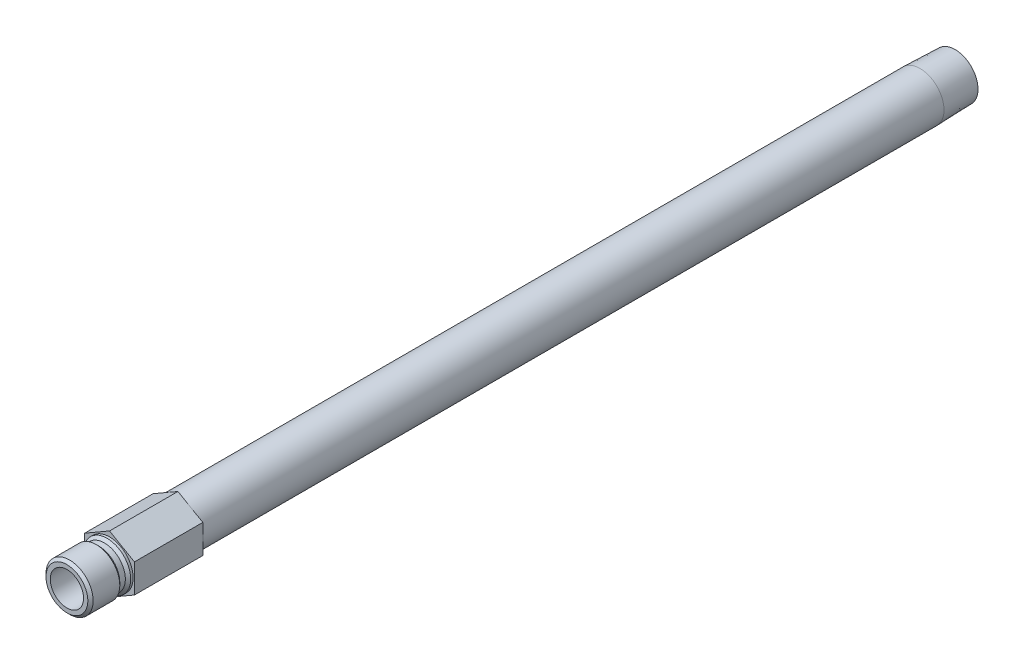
ISO-10303-21;
HEADER;
FILE_DESCRIPTION(('STEP AP214'),'2;1');
FILE_NAME('part.step','',(''),(''),'','','');
FILE_SCHEMA(('AUTOMOTIVE_DESIGN { 1 0 10303 214 1 1 1 1 }'));
ENDSEC;
DATA;
#1=APPLICATION_CONTEXT('core data for automotive mechanical design processes');
#2=APPLICATION_PROTOCOL_DEFINITION('international standard','automotive_design',2000,#1);
#3=PRODUCT_CONTEXT('',#1,'mechanical');
#4=PRODUCT('Part','Part','',(#3));
#5=PRODUCT_RELATED_PRODUCT_CATEGORY('part','',(#4));
#6=PRODUCT_DEFINITION_FORMATION('','',#4);
#7=PRODUCT_DEFINITION_CONTEXT('part definition',#1,'design');
#8=PRODUCT_DEFINITION('design','',#6,#7);
#9=PRODUCT_DEFINITION_SHAPE('','',#8);
#10=(LENGTH_UNIT() NAMED_UNIT(*) SI_UNIT(.MILLI.,.METRE.));
#11=(NAMED_UNIT(*) PLANE_ANGLE_UNIT() SI_UNIT($,.RADIAN.));
#12=(NAMED_UNIT(*) SI_UNIT($,.STERADIAN.) SOLID_ANGLE_UNIT());
#13=UNCERTAINTY_MEASURE_WITH_UNIT(LENGTH_MEASURE(1.E-05),#10,'distance_accuracy_value','');
#14=(GEOMETRIC_REPRESENTATION_CONTEXT(3) GLOBAL_UNCERTAINTY_ASSIGNED_CONTEXT((#13)) GLOBAL_UNIT_ASSIGNED_CONTEXT((#10,
#11,#12)) REPRESENTATION_CONTEXT('',''));
#15=CARTESIAN_POINT('',(0.,0.,0.));
#16=DIRECTION('',(0.,0.,1.));
#17=DIRECTION('',(1.,0.,0.));
#18=AXIS2_PLACEMENT_3D('',#15,#16,#17);
#19=CARTESIAN_POINT('',(0.,0.,0.));
#20=DIRECTION('',(0.,0.,-1.));
#21=DIRECTION('',(0.,1.,0.));
#22=AXIS2_PLACEMENT_3D('',#19,#20,#21);
#23=CYLINDRICAL_SURFACE('',#22,4.7625);
#24=CARTESIAN_POINT('',(0.,0.,0.));
#25=DIRECTION('',(0.,0.,1.));
#26=DIRECTION('',(1.,0.,0.));
#27=AXIS2_PLACEMENT_3D('',#24,#25,#26);
#28=CIRCLE('',#27,4.7625);
#29=CARTESIAN_POINT('',(4.7625,0.,0.));
#30=VERTEX_POINT('',#29);
#31=EDGE_CURVE('E138',#30,#30,#28,.T.);
#32=ORIENTED_EDGE('',*,*,#31,.F.);
#33=EDGE_LOOP('',(#32));
#34=FACE_BOUND('',#33,.T.);
#35=CARTESIAN_POINT('',(0.,0.,12.192));
#36=DIRECTION('',(0.,0.,-1.));
#37=DIRECTION('',(0.,1.,0.));
#38=AXIS2_PLACEMENT_3D('',#35,#36,#37);
#39=CIRCLE('',#38,4.7625);
#40=CARTESIAN_POINT('',(0.,4.7625,12.192));
#41=VERTEX_POINT('',#40);
#42=EDGE_CURVE('E11',#41,#41,#39,.T.);
#43=ORIENTED_EDGE('',*,*,#42,.F.);
#44=EDGE_LOOP('',(#43));
#45=FACE_BOUND('',#44,.T.);
#46=ADVANCED_FACE('F33',(#34,#45),#23,.F.);
#47=CARTESIAN_POINT('',(0.,4.7625,12.192));
#48=DIRECTION('',(0.,0.,1.));
#49=DIRECTION('',(0.,-1.,0.));
#50=AXIS2_PLACEMENT_3D('',#47,#48,#49);
#51=PLANE('',#50);
#52=ORIENTED_EDGE('',*,*,#42,.T.);
#53=EDGE_LOOP('',(#52));
#54=FACE_BOUND('',#53,.T.);
#55=CARTESIAN_POINT('',(0.,0.,12.192));
#56=DIRECTION('',(0.,0.,-1.));
#57=DIRECTION('',(0.,1.,0.));
#58=AXIS2_PLACEMENT_3D('',#55,#56,#57);
#59=CIRCLE('',#58,5.9817);
#60=CARTESIAN_POINT('',(0.,5.9817,12.192));
#61=VERTEX_POINT('',#60);
#62=EDGE_CURVE('E41',#61,#61,#59,.T.);
#63=ORIENTED_EDGE('',*,*,#62,.F.);
#64=EDGE_LOOP('',(#63));
#65=FACE_BOUND('',#64,.T.);
#66=ADVANCED_FACE('F181',(#54,#65),#51,.T.);
#67=CARTESIAN_POINT('',(0.,0.,11.43));
#68=DIRECTION('',(0.,0.,-1.));
#69=DIRECTION('',(0.,1.,0.));
#70=AXIS2_PLACEMENT_3D('',#67,#68,#69);
#71=CONICAL_SURFACE('',#70,6.7437,0.785398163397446);
#72=ORIENTED_EDGE('',*,*,#62,.T.);
#73=EDGE_LOOP('',(#72));
#74=FACE_BOUND('',#73,.T.);
#75=CARTESIAN_POINT('',(0.,0.,11.43));
#76=DIRECTION('',(0.,0.,-1.));
#77=DIRECTION('',(0.,1.,0.));
#78=AXIS2_PLACEMENT_3D('',#75,#76,#77);
#79=CIRCLE('',#78,6.7437);
#80=CARTESIAN_POINT('',(0.,6.7437,11.43));
#81=VERTEX_POINT('',#80);
#82=EDGE_CURVE('E173',#81,#81,#79,.T.);
#83=ORIENTED_EDGE('',*,*,#82,.F.);
#84=EDGE_LOOP('',(#83));
#85=FACE_BOUND('',#84,.T.);
#86=ADVANCED_FACE('F178',(#74,#85),#71,.T.);
#87=CARTESIAN_POINT('',(0.,0.,0.));
#88=DIRECTION('',(0.,0.,-1.));
#89=DIRECTION('',(0.,1.,0.));
#90=AXIS2_PLACEMENT_3D('',#87,#88,#89);
#91=CYLINDRICAL_SURFACE('',#90,6.7437);
#92=ORIENTED_EDGE('',*,*,#82,.T.);
#93=EDGE_LOOP('',(#92));
#94=FACE_BOUND('',#93,.T.);
#95=CARTESIAN_POINT('',(0.,0.,3.81));
#96=DIRECTION('',(0.,0.,-1.));
#97=DIRECTION('',(0.,1.,0.));
#98=AXIS2_PLACEMENT_3D('',#95,#96,#97);
#99=CIRCLE('',#98,6.7437);
#100=CARTESIAN_POINT('',(0.,6.7437,3.81));
#101=VERTEX_POINT('',#100);
#102=EDGE_CURVE('E170',#101,#101,#99,.T.);
#103=ORIENTED_EDGE('',*,*,#102,.F.);
#104=EDGE_LOOP('',(#103));
#105=FACE_BOUND('',#104,.T.);
#106=ADVANCED_FACE('F188',(#94,#105),#91,.T.);
#107=CARTESIAN_POINT('',(0.,0.,3.048));
#108=DIRECTION('',(0.,0.,1.));
#109=DIRECTION('',(0.,-1.,0.));
#110=AXIS2_PLACEMENT_3D('',#107,#108,#109);
#111=CONICAL_SURFACE('',#110,5.9817,0.785398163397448);
#112=ORIENTED_EDGE('',*,*,#102,.T.);
#113=EDGE_LOOP('',(#112));
#114=FACE_BOUND('',#113,.T.);
#115=CARTESIAN_POINT('',(0.,0.,3.048));
#116=DIRECTION('',(0.,0.,-1.));
#117=DIRECTION('',(0.,1.,0.));
#118=AXIS2_PLACEMENT_3D('',#115,#116,#117);
#119=CIRCLE('',#118,5.9817);
#120=CARTESIAN_POINT('',(0.,5.9817,3.048));
#121=VERTEX_POINT('',#120);
#122=EDGE_CURVE('E167',#121,#121,#119,.T.);
#123=ORIENTED_EDGE('',*,*,#122,.F.);
#124=EDGE_LOOP('',(#123));
#125=FACE_BOUND('',#124,.T.);
#126=ADVANCED_FACE('F194',(#114,#125),#111,.T.);
#127=CARTESIAN_POINT('',(0.,0.,0.));
#128=DIRECTION('',(0.,0.,-1.));
#129=DIRECTION('',(0.,1.,0.));
#130=AXIS2_PLACEMENT_3D('',#127,#128,#129);
#131=CYLINDRICAL_SURFACE('',#130,5.9817);
#132=ORIENTED_EDGE('',*,*,#122,.T.);
#133=EDGE_LOOP('',(#132));
#134=FACE_BOUND('',#133,.T.);
#135=CARTESIAN_POINT('',(0.,0.,1.4605));
#136=DIRECTION('',(0.,0.,-1.));
#137=DIRECTION('',(0.,1.,0.));
#138=AXIS2_PLACEMENT_3D('',#135,#136,#137);
#139=CIRCLE('',#138,5.9817);
#140=CARTESIAN_POINT('',(0.,5.9817,1.4605));
#141=VERTEX_POINT('',#140);
#142=EDGE_CURVE('E164',#141,#141,#139,.T.);
#143=ORIENTED_EDGE('',*,*,#142,.F.);
#144=EDGE_LOOP('',(#143));
#145=FACE_BOUND('',#144,.T.);
#146=ADVANCED_FACE('F198',(#134,#145),#131,.T.);
#147=CARTESIAN_POINT('',(0.,0.,0.698499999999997));
#148=DIRECTION('',(0.,0.,-1.));
#149=DIRECTION('',(0.,1.,0.));
#150=AXIS2_PLACEMENT_3D('',#147,#148,#149);
#151=CONICAL_SURFACE('',#150,6.7437,0.785398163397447);
#152=ORIENTED_EDGE('',*,*,#142,.T.);
#153=EDGE_LOOP('',(#152));
#154=FACE_BOUND('',#153,.T.);
#155=CARTESIAN_POINT('',(0.,0.,0.698499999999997));
#156=DIRECTION('',(0.,0.,-1.));
#157=DIRECTION('',(0.,1.,0.));
#158=AXIS2_PLACEMENT_3D('',#155,#156,#157);
#159=CIRCLE('',#158,6.7437);
#160=CARTESIAN_POINT('',(0.,6.7437,0.698499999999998));
#161=VERTEX_POINT('',#160);
#162=EDGE_CURVE('E161',#161,#161,#159,.T.);
#163=ORIENTED_EDGE('',*,*,#162,.F.);
#164=EDGE_LOOP('',(#163));
#165=FACE_BOUND('',#164,.T.);
#166=ADVANCED_FACE('F202',(#154,#165),#151,.T.);
#167=CARTESIAN_POINT('',(0.,0.,0.));
#168=DIRECTION('',(0.,0.,-1.));
#169=DIRECTION('',(0.,1.,0.));
#170=AXIS2_PLACEMENT_3D('',#167,#168,#169);
#171=CYLINDRICAL_SURFACE('',#170,6.7437);
#172=ORIENTED_EDGE('',*,*,#162,.T.);
#173=EDGE_LOOP('',(#172));
#174=FACE_BOUND('',#173,.T.);
#175=CARTESIAN_POINT('',(0.,0.,0.));
#176=DIRECTION('',(0.,0.,-1.));
#177=DIRECTION('',(0.,1.,0.));
#178=AXIS2_PLACEMENT_3D('',#175,#176,#177);
#179=CIRCLE('',#178,6.7437);
#180=CARTESIAN_POINT('',(0.,6.7437,0.));
#181=VERTEX_POINT('',#180);
#182=EDGE_CURVE('E158',#181,#181,#179,.T.);
#183=ORIENTED_EDGE('',*,*,#182,.F.);
#184=EDGE_LOOP('',(#183));
#185=FACE_BOUND('',#184,.T.);
#186=ADVANCED_FACE('F206',(#174,#185),#171,.T.);
#187=CARTESIAN_POINT('',(0.,6.7437,0.));
#188=DIRECTION('',(0.,0.,1.));
#189=DIRECTION('',(0.,-1.,0.));
#190=AXIS2_PLACEMENT_3D('',#187,#188,#189);
#191=PLANE('',#190);
#192=ORIENTED_EDGE('',*,*,#182,.T.);
#193=EDGE_LOOP('',(#192));
#194=FACE_BOUND('',#193,.T.);
#195=DIRECTION('',(-0.866025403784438,-0.5,0.));
#196=VECTOR('',#195,1.);
#197=CARTESIAN_POINT('',(0.,8.21223022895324,0.));
#198=LINE('',#197,#196);
#199=CARTESIAN_POINT('',(0.,8.21223022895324,0.));
#200=VERTEX_POINT('',#199);
#201=CARTESIAN_POINT('',(-7.112,4.10611511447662,0.));
#202=VERTEX_POINT('',#201);
#203=EDGE_CURVE('E120',#200,#202,#198,.T.);
#204=ORIENTED_EDGE('',*,*,#203,.T.);
#205=DIRECTION('',(0.,-1.,0.));
#206=VECTOR('',#205,1.);
#207=CARTESIAN_POINT('',(-7.112,4.10611511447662,0.));
#208=LINE('',#207,#206);
#209=CARTESIAN_POINT('',(-7.112,-4.10611511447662,0.));
#210=VERTEX_POINT('',#209);
#211=EDGE_CURVE('E123',#202,#210,#208,.T.);
#212=ORIENTED_EDGE('',*,*,#211,.T.);
#213=DIRECTION('',(0.866025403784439,-0.5,0.));
#214=VECTOR('',#213,1.);
#215=CARTESIAN_POINT('',(-7.112,-4.10611511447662,0.));
#216=LINE('',#215,#214);
#217=CARTESIAN_POINT('',(0.,-8.21223022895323,0.));
#218=VERTEX_POINT('',#217);
#219=EDGE_CURVE('E127',#210,#218,#216,.T.);
#220=ORIENTED_EDGE('',*,*,#219,.T.);
#221=DIRECTION('',(0.866025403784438,0.5,0.));
#222=VECTOR('',#221,1.);
#223=CARTESIAN_POINT('',(0.,-8.21223022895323,0.));
#224=LINE('',#223,#222);
#225=CARTESIAN_POINT('',(7.112,-4.10611511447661,0.));
#226=VERTEX_POINT('',#225);
#227=EDGE_CURVE('E130',#218,#226,#224,.T.);
#228=ORIENTED_EDGE('',*,*,#227,.T.);
#229=DIRECTION('',(0.,1.,0.));
#230=VECTOR('',#229,1.);
#231=CARTESIAN_POINT('',(7.112,-4.10611511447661,0.));
#232=LINE('',#231,#230);
#233=CARTESIAN_POINT('',(7.112,4.10611511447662,0.));
#234=VERTEX_POINT('',#233);
#235=EDGE_CURVE('E97',#226,#234,#232,.T.);
#236=ORIENTED_EDGE('',*,*,#235,.T.);
#237=DIRECTION('',(-0.866025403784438,0.5,0.));
#238=VECTOR('',#237,1.);
#239=CARTESIAN_POINT('',(7.112,4.10611511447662,0.));
#240=LINE('',#239,#238);
#241=EDGE_CURVE('E133',#234,#200,#240,.T.);
#242=ORIENTED_EDGE('',*,*,#241,.T.);
#243=EDGE_LOOP('',(#204,#212,#220,#228,#236,#242));
#244=FACE_BOUND('',#243,.T.);
#245=ADVANCED_FACE('F210',(#194,#244),#191,.T.);
#246=CARTESIAN_POINT('',(-7.112,4.10611511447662,0.));
#247=DIRECTION('',(0.,0.,1.));
#248=DIRECTION('',(1.,0.,0.));
#249=AXIS2_PLACEMENT_3D('',#246,#247,#248);
#250=PLANE('',#249);
#251=ORIENTED_EDGE('',*,*,#31,.T.);
#252=EDGE_LOOP('',(#251));
#253=FACE_BOUND('',#252,.T.);
#254=CARTESIAN_POINT('',(0.,0.,0.));
#255=DIRECTION('',(0.,0.,1.));
#256=DIRECTION('',(1.,0.,0.));
#257=AXIS2_PLACEMENT_3D('',#254,#255,#256);
#258=CIRCLE('',#257,4.62279999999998);
#259=CARTESIAN_POINT('',(4.62279999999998,0.,0.));
#260=VERTEX_POINT('',#259);
#261=EDGE_CURVE('E124',#260,#260,#258,.T.);
#262=ORIENTED_EDGE('',*,*,#261,.F.);
#263=EDGE_LOOP('',(#262));
#264=FACE_BOUND('',#263,.T.);
#265=ADVANCED_FACE('F214',(#253,#264),#250,.T.);
#266=CARTESIAN_POINT('',(0.,0.,-241.808));
#267=DIRECTION('',(0.,0.,1.));
#268=DIRECTION('',(0.,-1.,0.));
#269=AXIS2_PLACEMENT_3D('',#266,#267,#268);
#270=CONICAL_SURFACE('',#269,6.54447060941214,0.0312396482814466);
#271=CARTESIAN_POINT('',(0.,0.,-231.775));
#272=DIRECTION('',(0.,0.,-1.));
#273=DIRECTION('',(0.,1.,0.));
#274=AXIS2_PLACEMENT_3D('',#271,#272,#273);
#275=CIRCLE('',#274,6.85799999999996);
#276=CARTESIAN_POINT('',(0.,6.858,-231.775));
#277=VERTEX_POINT('',#276);
#278=EDGE_CURVE('E155',#277,#277,#275,.T.);
#279=ORIENTED_EDGE('',*,*,#278,.T.);
#280=EDGE_LOOP('',(#279));
#281=FACE_BOUND('',#280,.T.);
#282=CARTESIAN_POINT('',(0.,0.,-241.808));
#283=DIRECTION('',(0.,0.,-1.));
#284=DIRECTION('',(0.,1.,0.));
#285=AXIS2_PLACEMENT_3D('',#282,#283,#284);
#286=CIRCLE('',#285,6.54447060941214);
#287=CARTESIAN_POINT('',(0.,6.54447060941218,-241.808));
#288=VERTEX_POINT('',#287);
#289=EDGE_CURVE('E152',#288,#288,#286,.T.);
#290=ORIENTED_EDGE('',*,*,#289,.F.);
#291=EDGE_LOOP('',(#290));
#292=FACE_BOUND('',#291,.T.);
#293=ADVANCED_FACE('F220',(#281,#292),#270,.T.);
#294=CARTESIAN_POINT('',(0.,0.,0.));
#295=DIRECTION('',(0.,0.,-1.));
#296=DIRECTION('',(0.,1.,0.));
#297=AXIS2_PLACEMENT_3D('',#294,#295,#296);
#298=CYLINDRICAL_SURFACE('',#297,6.85799999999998);
#299=ORIENTED_EDGE('',*,*,#278,.F.);
#300=EDGE_LOOP('',(#299));
#301=FACE_BOUND('',#300,.T.);
#302=CARTESIAN_POINT('',(0.,0.,-19.558));
#303=DIRECTION('',(0.,0.,1.));
#304=DIRECTION('',(1.,0.,0.));
#305=AXIS2_PLACEMENT_3D('',#302,#303,#304);
#306=CIRCLE('',#305,6.85799999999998);
#307=CARTESIAN_POINT('',(6.85799999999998,0.,-19.558));
#308=VERTEX_POINT('',#307);
#309=EDGE_CURVE('E146',#308,#308,#306,.F.);
#310=ORIENTED_EDGE('',*,*,#309,.T.);
#311=EDGE_LOOP('',(#310));
#312=FACE_BOUND('',#311,.T.);
#313=ADVANCED_FACE('F216',(#301,#312),#298,.T.);
#314=CARTESIAN_POINT('',(0.,6.54447060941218,-241.808));
#315=DIRECTION('',(0.,0.,-1.));
#316=DIRECTION('',(0.,1.,0.));
#317=AXIS2_PLACEMENT_3D('',#314,#315,#316);
#318=PLANE('',#317);
#319=ORIENTED_EDGE('',*,*,#289,.T.);
#320=EDGE_LOOP('',(#319));
#321=FACE_BOUND('',#320,.T.);
#322=CARTESIAN_POINT('',(0.,0.,-241.808));
#323=DIRECTION('',(0.,0.,-1.));
#324=DIRECTION('',(0.,1.,0.));
#325=AXIS2_PLACEMENT_3D('',#322,#323,#324);
#326=CIRCLE('',#325,4.62279999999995);
#327=CARTESIAN_POINT('',(0.,4.6228,-241.808));
#328=VERTEX_POINT('',#327);
#329=EDGE_CURVE('E149',#328,#328,#326,.T.);
#330=ORIENTED_EDGE('',*,*,#329,.F.);
#331=EDGE_LOOP('',(#330));
#332=FACE_BOUND('',#331,.T.);
#333=ADVANCED_FACE('F219',(#321,#332),#318,.T.);
#334=CARTESIAN_POINT('',(0.,0.,0.));
#335=DIRECTION('',(0.,0.,-1.));
#336=DIRECTION('',(0.,1.,0.));
#337=AXIS2_PLACEMENT_3D('',#334,#335,#336);
#338=CYLINDRICAL_SURFACE('',#337,4.62279999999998);
#339=ORIENTED_EDGE('',*,*,#261,.T.);
#340=EDGE_LOOP('',(#339));
#341=FACE_BOUND('',#340,.T.);
#342=ORIENTED_EDGE('',*,*,#329,.T.);
#343=EDGE_LOOP('',(#342));
#344=FACE_BOUND('',#343,.T.);
#345=ADVANCED_FACE('F227',(#341,#344),#338,.F.);
#346=CARTESIAN_POINT('',(0.,8.21223022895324,-19.558));
#347=DIRECTION('',(-0.5,0.866025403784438,0.));
#348=DIRECTION('',(-0.866025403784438,-0.5,0.));
#349=AXIS2_PLACEMENT_3D('',#346,#347,#348);
#350=PLANE('',#349);
#351=ORIENTED_EDGE('',*,*,#203,.F.);
#352=DIRECTION('',(0.,0.,1.));
#353=VECTOR('',#352,1.);
#354=CARTESIAN_POINT('',(0.,8.21223022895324,-19.558));
#355=LINE('',#354,#353);
#356=CARTESIAN_POINT('',(0.,8.21223022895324,-19.558));
#357=VERTEX_POINT('',#356);
#358=EDGE_CURVE('E49',#357,#200,#355,.T.);
#359=ORIENTED_EDGE('',*,*,#358,.F.);
#360=DIRECTION('',(-0.866025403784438,-0.5,0.));
#361=VECTOR('',#360,1.);
#362=CARTESIAN_POINT('',(0.,8.21223022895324,-19.558));
#363=LINE('',#362,#361);
#364=CARTESIAN_POINT('',(-7.112,4.10611511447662,-19.558));
#365=VERTEX_POINT('',#364);
#366=EDGE_CURVE('E136',#357,#365,#363,.T.);
#367=ORIENTED_EDGE('',*,*,#366,.T.);
#368=DIRECTION('',(0.,0.,1.));
#369=VECTOR('',#368,1.);
#370=CARTESIAN_POINT('',(-7.112,4.10611511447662,-19.558));
#371=LINE('',#370,#369);
#372=EDGE_CURVE('E84',#365,#202,#371,.T.);
#373=ORIENTED_EDGE('',*,*,#372,.T.);
#374=EDGE_LOOP('',(#351,#359,#367,#373));
#375=FACE_BOUND('',#374,.T.);
#376=ADVANCED_FACE('F231',(#375),#350,.T.);
#377=CARTESIAN_POINT('',(7.112,4.10611511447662,-19.558));
#378=DIRECTION('',(0.5,0.866025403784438,0.));
#379=DIRECTION('',(-0.866025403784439,0.5,0.));
#380=AXIS2_PLACEMENT_3D('',#377,#378,#379);
#381=PLANE('',#380);
#382=ORIENTED_EDGE('',*,*,#241,.F.);
#383=DIRECTION('',(0.,0.,1.));
#384=VECTOR('',#383,1.);
#385=CARTESIAN_POINT('',(7.112,4.10611511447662,-19.558));
#386=LINE('',#385,#384);
#387=CARTESIAN_POINT('',(7.112,4.10611511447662,-19.558));
#388=VERTEX_POINT('',#387);
#389=EDGE_CURVE('E72',#388,#234,#386,.T.);
#390=ORIENTED_EDGE('',*,*,#389,.F.);
#391=DIRECTION('',(-0.866025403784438,0.5,0.));
#392=VECTOR('',#391,1.);
#393=CARTESIAN_POINT('',(7.112,4.10611511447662,-19.558));
#394=LINE('',#393,#392);
#395=EDGE_CURVE('E110',#388,#357,#394,.T.);
#396=ORIENTED_EDGE('',*,*,#395,.T.);
#397=ORIENTED_EDGE('',*,*,#358,.T.);
#398=EDGE_LOOP('',(#382,#390,#396,#397));
#399=FACE_BOUND('',#398,.T.);
#400=ADVANCED_FACE('F235',(#399),#381,.T.);
#401=CARTESIAN_POINT('',(7.112,-4.10611511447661,-19.558));
#402=DIRECTION('',(1.,0.,0.));
#403=DIRECTION('',(0.,1.,0.));
#404=AXIS2_PLACEMENT_3D('',#401,#402,#403);
#405=PLANE('',#404);
#406=ORIENTED_EDGE('',*,*,#235,.F.);
#407=DIRECTION('',(0.,0.,1.));
#408=VECTOR('',#407,1.);
#409=CARTESIAN_POINT('',(7.112,-4.10611511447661,-19.558));
#410=LINE('',#409,#408);
#411=CARTESIAN_POINT('',(7.112,-4.10611511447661,-19.558));
#412=VERTEX_POINT('',#411);
#413=EDGE_CURVE('E92',#412,#226,#410,.T.);
#414=ORIENTED_EDGE('',*,*,#413,.F.);
#415=DIRECTION('',(0.,1.,0.));
#416=VECTOR('',#415,1.);
#417=CARTESIAN_POINT('',(7.112,-4.10611511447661,-19.558));
#418=LINE('',#417,#416);
#419=EDGE_CURVE('E95',#412,#388,#418,.T.);
#420=ORIENTED_EDGE('',*,*,#419,.T.);
#421=ORIENTED_EDGE('',*,*,#389,.T.);
#422=EDGE_LOOP('',(#406,#414,#420,#421));
#423=FACE_BOUND('',#422,.T.);
#424=ADVANCED_FACE('F94',(#423),#405,.T.);
#425=CARTESIAN_POINT('',(0.,-8.21223022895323,-19.558));
#426=DIRECTION('',(0.5,-0.866025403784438,0.));
#427=DIRECTION('',(0.866025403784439,0.5,0.));
#428=AXIS2_PLACEMENT_3D('',#425,#426,#427);
#429=PLANE('',#428);
#430=ORIENTED_EDGE('',*,*,#227,.F.);
#431=DIRECTION('',(0.,0.,1.));
#432=VECTOR('',#431,1.);
#433=CARTESIAN_POINT('',(0.,-8.21223022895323,-19.558));
#434=LINE('',#433,#432);
#435=CARTESIAN_POINT('',(0.,-8.21223022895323,-19.558));
#436=VERTEX_POINT('',#435);
#437=EDGE_CURVE('E102',#436,#218,#434,.T.);
#438=ORIENTED_EDGE('',*,*,#437,.F.);
#439=DIRECTION('',(0.866025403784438,0.5,0.));
#440=VECTOR('',#439,1.);
#441=CARTESIAN_POINT('',(0.,-8.21223022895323,-19.558));
#442=LINE('',#441,#440);
#443=EDGE_CURVE('E108',#436,#412,#442,.T.);
#444=ORIENTED_EDGE('',*,*,#443,.T.);
#445=ORIENTED_EDGE('',*,*,#413,.T.);
#446=EDGE_LOOP('',(#430,#438,#444,#445));
#447=FACE_BOUND('',#446,.T.);
#448=ADVANCED_FACE('F112',(#447),#429,.T.);
#449=CARTESIAN_POINT('',(-7.112,-4.10611511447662,-19.558));
#450=DIRECTION('',(-0.5,-0.866025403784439,0.));
#451=DIRECTION('',(0.866025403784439,-0.5,0.));
#452=AXIS2_PLACEMENT_3D('',#449,#450,#451);
#453=PLANE('',#452);
#454=ORIENTED_EDGE('',*,*,#219,.F.);
#455=DIRECTION('',(0.,0.,1.));
#456=VECTOR('',#455,1.);
#457=CARTESIAN_POINT('',(-7.112,-4.10611511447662,-19.558));
#458=LINE('',#457,#456);
#459=CARTESIAN_POINT('',(-7.112,-4.10611511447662,-19.558));
#460=VERTEX_POINT('',#459);
#461=EDGE_CURVE('E141',#460,#210,#458,.T.);
#462=ORIENTED_EDGE('',*,*,#461,.F.);
#463=DIRECTION('',(0.866025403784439,-0.5,0.));
#464=VECTOR('',#463,1.);
#465=CARTESIAN_POINT('',(-7.112,-4.10611511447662,-19.558));
#466=LINE('',#465,#464);
#467=EDGE_CURVE('E113',#460,#436,#466,.T.);
#468=ORIENTED_EDGE('',*,*,#467,.T.);
#469=ORIENTED_EDGE('',*,*,#437,.T.);
#470=EDGE_LOOP('',(#454,#462,#468,#469));
#471=FACE_BOUND('',#470,.T.);
#472=ADVANCED_FACE('F239',(#471),#453,.T.);
#473=CARTESIAN_POINT('',(-7.112,4.10611511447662,-19.558));
#474=DIRECTION('',(-1.,0.,0.));
#475=DIRECTION('',(0.,-1.,0.));
#476=AXIS2_PLACEMENT_3D('',#473,#474,#475);
#477=PLANE('',#476);
#478=ORIENTED_EDGE('',*,*,#211,.F.);
#479=ORIENTED_EDGE('',*,*,#372,.F.);
#480=DIRECTION('',(0.,-1.,0.));
#481=VECTOR('',#480,1.);
#482=CARTESIAN_POINT('',(-7.112,4.10611511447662,-19.558));
#483=LINE('',#482,#481);
#484=EDGE_CURVE('E115',#365,#460,#483,.T.);
#485=ORIENTED_EDGE('',*,*,#484,.T.);
#486=ORIENTED_EDGE('',*,*,#461,.T.);
#487=EDGE_LOOP('',(#478,#479,#485,#486));
#488=FACE_BOUND('',#487,.T.);
#489=ADVANCED_FACE('F236',(#488),#477,.T.);
#490=CARTESIAN_POINT('',(-7.112,4.10611511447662,-19.558));
#491=DIRECTION('',(0.,0.,1.));
#492=DIRECTION('',(1.,0.,0.));
#493=AXIS2_PLACEMENT_3D('',#490,#491,#492);
#494=PLANE('',#493);
#495=ORIENTED_EDGE('',*,*,#309,.F.);
#496=EDGE_LOOP('',(#495));
#497=FACE_BOUND('',#496,.T.);
#498=ORIENTED_EDGE('',*,*,#366,.F.);
#499=ORIENTED_EDGE('',*,*,#395,.F.);
#500=ORIENTED_EDGE('',*,*,#419,.F.);
#501=ORIENTED_EDGE('',*,*,#443,.F.);
#502=ORIENTED_EDGE('',*,*,#467,.F.);
#503=ORIENTED_EDGE('',*,*,#484,.F.);
#504=EDGE_LOOP('',(#498,#499,#500,#501,#502,#503));
#505=FACE_BOUND('',#504,.T.);
#506=ADVANCED_FACE('F106',(#497,#505),#494,.F.);
#507=CLOSED_SHELL('',(#46,#66,#86,#106,#126,#146,#166,#186,#245,#265,#293,#313,#333,#345,#376,
#400,#424,#448,#472,#489,#506));
#508=MANIFOLD_SOLID_BREP('B2',#507);
#509=ADVANCED_BREP_SHAPE_REPRESENTATION('',(#18,#508),#14);
#510=SHAPE_DEFINITION_REPRESENTATION(#9,#509);
ENDSEC;
END-ISO-10303-21;
